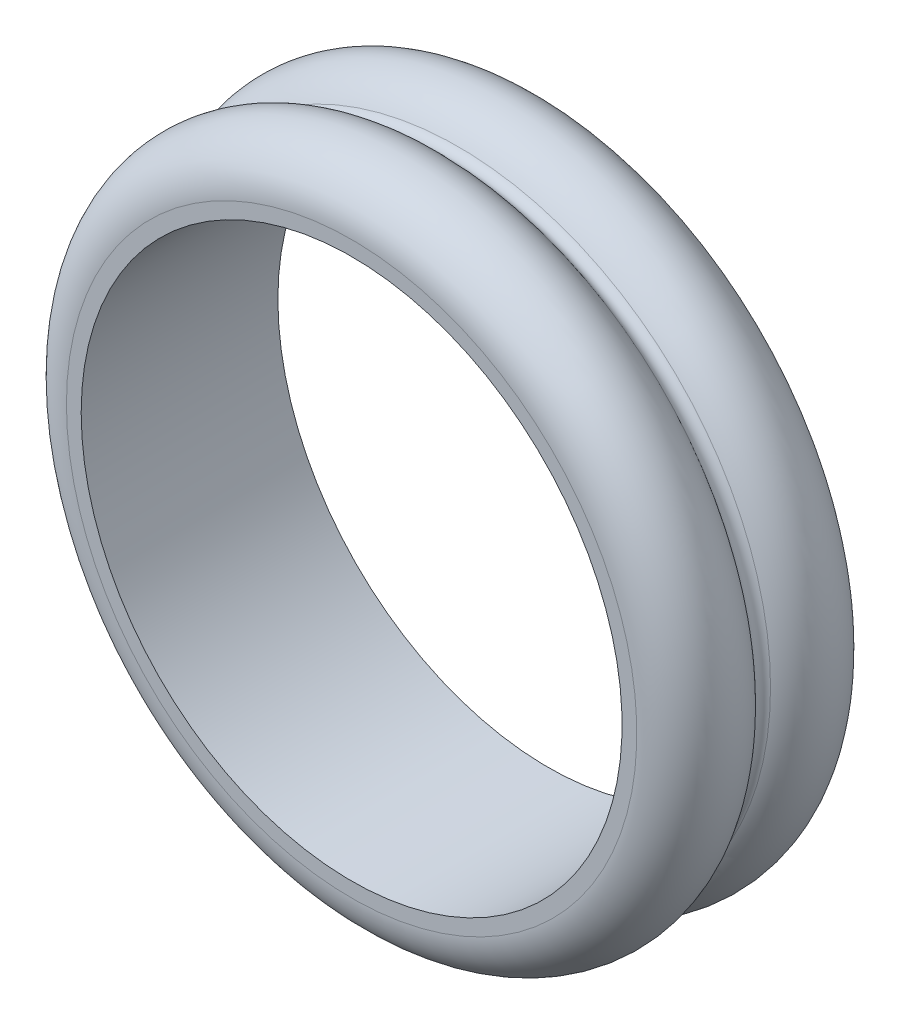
from build123d import *

# Parameters (mm, degrees)
SKETCH_2_R               = 5
EXTRUDE_1_DEPTH          = 10
PATTERN_CIRCULAR_1_COUNT = 6
EXTRUDE_2_DEPTH          = 7
SKETCH_4_R               = 1.4
CUT_EXTRUDE_1_DEPTH      = 50.325449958
PATTERN_CIRCULAR_2_COUNT = 6
SKETCH_5_R               = 5.5
EXTRUDE_3_DEPTH          = 5
SKETCH_7_R               = 7
CUT_EXTRUDE_3_DEPTH      = 1.5
CUT_EXTRUDE_3_DRAFT      = -40
SKETCH_8_R               = 1.5
CUT_EXTRUDE_4_DEPTH      = 51.222007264
SKETCH_10_R              = 1.25
CUT_EXTRUDE_6_DEPTH      = 51.675437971
PATTERN_CIRCULAR_3_COUNT = 6
SKETCH_11_R              = 2.5
CUT_EXTRUDE_7_DEPTH      = 51.675437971
PATTERN_CIRCULAR_4_COUNT = 2
CUT_EXTRUDE_8_DEPTH      = 8
PATTERN_CIRCULAR_5_COUNT = 6
CUT_EXTRUDE_9_DEPTH      = 8
SKETCH_14_R              = 27.5
CUT_EXTRUDE_11_DEPTH     = 55


with BuildPart() as part:
    # Sketch 1 → Revolve 1 (revolve)
    with BuildSketch(Plane(origin=(0, 0, 0), x_dir=(1, 0, 0), z_dir=(0, 1, 0)), mode=Mode.PRIVATE) as revolve_1_sk:
        with BuildLine():
            Line((25, 10), (25, -10))
            Line((25, -10), (29, -10))
            ThreePointArc((29, -10), (33.787135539, -6.443375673), (31.763853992, -0.833333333))
            ThreePointArc((31.763853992, -0.833333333), (31.31662479, 0), (31.763853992, 0.833333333))
            ThreePointArc((31.763853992, 0.833333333), (33.787135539, 6.443375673), (29, 10))
            Line((29, 10), (25, 10))
        make_face()
    revolve(revolve_1_sk.sketch.rotate(Axis((0, 0, -146.934042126), (0, 0, 1)), 180), axis=Axis((0, 0, -146.934042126), (0, 0, 1)))

    # Sketch 2 → Extrude 1 (add)
    with BuildSketch(Plane.XY.offset(6)):
        with Locations((0, 21.5)):
            Circle(SKETCH_2_R)
    extrude_1 = extrude(amount=-EXTRUDE_1_DEPTH)

    # Pattern Circular 1: Extrude 1 ×6 about axis
    pattern_circular_1_axis = Axis((0, 0, 0), (0, 0, 1))
    for i in range(1, PATTERN_CIRCULAR_1_COUNT):
        add(extrude_1.rotate(pattern_circular_1_axis, i * 360 / PATTERN_CIRCULAR_1_COUNT))

    # Sketch 3 → Extrude 2 (add)
    with BuildSketch(Plane.XY.offset(6)):
        with BuildLine():
            Line((-8.082903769, 0), (-10.874355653, -4.834936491))
            Line((-10.874355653, -4.834936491), (-15.051918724, -7.246853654))
            ThreePointArc((-15.051918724, -7.246853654), (-14.289419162, -8.25), (-13.801918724, -9.411917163))
            Line((-13.801918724, -9.411917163), (-9.624355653, -7))
            Line((-9.624355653, -7), (-4.041451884, -7))
            Line((-4.041451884, -7), (-1.25, -11.834936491))
            Line((-1.25, -11.834936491), (-1.25, -16.658770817))
            ThreePointArc((-1.25, -16.658770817), (0, -16.5), (1.25, -16.658770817))
            Line((1.25, -16.658770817), (1.25, -11.834936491))
            Line((1.25, -11.834936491), (4.041451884, -7))
            Line((4.041451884, -7), (9.624355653, -7))
            Line((9.624355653, -7), (13.801918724, -9.411917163))
            ThreePointArc((13.801918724, -9.411917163), (14.289419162, -8.25), (15.051918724, -7.246853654))
            Line((15.051918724, -7.246853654), (10.874355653, -4.834936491))
            Line((10.874355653, -4.834936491), (8.082903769, 0))
            Line((8.082903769, 0), (10.874355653, 4.834936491))
            Line((10.874355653, 4.834936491), (15.051918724, 7.246853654))
            ThreePointArc((15.051918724, 7.246853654), (14.289419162, 8.25), (13.801918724, 9.411917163))
            Line((13.801918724, 9.411917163), (9.624355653, 7))
            Line((9.624355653, 7), (4.041451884, 7))
            Line((4.041451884, 7), (1.25, 11.834936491))
            Line((1.25, 11.834936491), (1.25, 16.658770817))
            ThreePointArc((1.25, 16.658770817), (0, 16.5), (-1.25, 16.658770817))
            Line((-1.25, 16.658770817), (-1.25, 11.834936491))
            Line((-1.25, 11.834936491), (-4.041451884, 7))
            Line((-4.041451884, 7), (-9.624355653, 7))
            Line((-9.624355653, 7), (-13.801918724, 9.411917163))
            ThreePointArc((-13.801918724, 9.411917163), (-14.289419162, 8.25), (-15.051918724, 7.246853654))
            Line((-15.051918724, 7.246853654), (-10.874355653, 4.834936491))
            Line((-10.874355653, 4.834936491), (-8.082903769, 0))
        make_face()
    extrude(amount=-EXTRUDE_2_DEPTH)

    # Sketch 4 → Cut-Extrude 1 (cut, through all)
    with BuildSketch(Plane(origin=(0, 0, -1), x_dir=(-1, 0, 0), z_dir=(0, 0, -1))):
        with Locations((0, 8.5)):
            Circle(SKETCH_4_R)
    cut_extrude_1 = extrude(amount=-CUT_EXTRUDE_1_DEPTH, mode=Mode.SUBTRACT)

    # Pattern Circular 2: Cut-Extrude 1 ×6 about axis
    pattern_circular_2_axis = Axis((0, 0, 0), (0, 0, 1))
    for i in range(1, PATTERN_CIRCULAR_2_COUNT):
        add(cut_extrude_1.rotate(pattern_circular_2_axis, i * 360 / PATTERN_CIRCULAR_2_COUNT), mode=Mode.SUBTRACT)

    # Sketch 5 → Extrude 3 (add)
    with BuildSketch(Plane(origin=(0, 0, -1), x_dir=(-1, 0, 0), z_dir=(0, 0, -1))):
        with Locations(Location((0, 0, 0), (0, 0, 180))):
            Circle(SKETCH_5_R)
    extrude(amount=EXTRUDE_3_DEPTH)


with BuildPart() as cut_extrude_3_tool:
    # Sketch 7 → Cut-Extrude 3 (with draft: the straight prism first)
    with BuildSketch(Plane.XY.offset(6)):
        Circle(SKETCH_7_R)
    extrude(amount=-CUT_EXTRUDE_3_DEPTH)
    # Cut-Extrude 3: the draft: its side faces are tilted about the plane it starts from
    cut_extrude_3_sides = [cut_extrude_3_tool.faces().sort_by_distance(p)[0] for p in [
        (-7, 0, 5.25),
    ]]
    draft(cut_extrude_3_sides, Plane.XY.offset(6), CUT_EXTRUDE_3_DRAFT)


with BuildPart() as part_1:
    add(part.part)

    # Cut-Extrude 3: cut by cut_extrude_3_tool
    add(cut_extrude_3_tool.part, mode=Mode.SUBTRACT)

    # Sketch 8 → Cut-Extrude 4 (cut, through all)
    with BuildSketch(Plane.XY.offset(4.5)):
        Circle(SKETCH_8_R)
    extrude(amount=-CUT_EXTRUDE_4_DEPTH, mode=Mode.SUBTRACT)

    # Sketch 10 → Cut-Extrude 6 (cut, through all)
    with BuildSketch(Plane.XY.offset(6)):
        with Locations((0, 21.5)):
            Circle(SKETCH_10_R)
    cut_extrude_6 = extrude(amount=-CUT_EXTRUDE_6_DEPTH, mode=Mode.SUBTRACT)

    # Pattern Circular 3: Cut-Extrude 6 ×6 about axis
    pattern_circular_3_axis = Axis((0, 0, 0), (0, 0, 1))
    for i in range(1, PATTERN_CIRCULAR_3_COUNT):
        add(cut_extrude_6.rotate(pattern_circular_3_axis, i * 360 / PATTERN_CIRCULAR_3_COUNT), mode=Mode.SUBTRACT)

    # Sketch 11 → Cut-Extrude 7 (cut, through all)
    with BuildSketch(Plane.XY.offset(6)):
        with Locations((0, 21.5)):
            Circle(SKETCH_11_R)
    cut_extrude_7 = extrude(amount=-CUT_EXTRUDE_7_DEPTH, mode=Mode.SUBTRACT)

    # Pattern Circular 4: Cut-Extrude 7 ×2 about axis
    pattern_circular_4_axis = Axis((0, 0, 0), (0, 0, 1))
    for i in range(1, PATTERN_CIRCULAR_4_COUNT):
        add(cut_extrude_7.rotate(pattern_circular_4_axis, i * 360 / PATTERN_CIRCULAR_4_COUNT), mode=Mode.SUBTRACT)

    # Sketch 12 → Cut-Extrude 8 (cut)
    with BuildSketch(Plane.XY.offset(6)):
        Polygon((20.062921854, 8.25), (21.506297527, 10.75), (20.062921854, 13.25), (17.176170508, 13.25), (15.732794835, 10.75), (17.176170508, 8.25), align=None)
    cut_extrude_8 = extrude(amount=-CUT_EXTRUDE_8_DEPTH, mode=Mode.SUBTRACT)

    # Pattern Circular 5: Cut-Extrude 8 ×6 about axis, 2 skipped
    pattern_circular_5_axis = Axis((0, 0, 0), (0, 0, -1))
    add([cut_extrude_8.rotate(pattern_circular_5_axis, i * 360 / PATTERN_CIRCULAR_5_COUNT) for i in range(1, PATTERN_CIRCULAR_5_COUNT) if i not in (2, 5)], mode=Mode.SUBTRACT)

    # Sketch 9 → Cut-Extrude 9 (cut)
    with BuildSketch(Plane(origin=(0, 0, -6), x_dir=(-1, 0, 0), z_dir=(0, 0, -1))):
        Polygon((3.5, 0), (1.75, 3.031088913), (-1.75, 3.031088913), (-3.5, 0), (-1.75, -3.031088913), (1.75, -3.031088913), align=None)
    extrude(amount=-CUT_EXTRUDE_9_DEPTH, mode=Mode.SUBTRACT)

    # Sketch 14 → Cut-Extrude 11 (cut)
    with BuildSketch(Plane(origin=(0, 0, -10), x_dir=(-1, 0, 0), z_dir=(0, 0, -1))):
        Circle(SKETCH_14_R)
    extrude(amount=-CUT_EXTRUDE_11_DEPTH, mode=Mode.SUBTRACT)


solid = part_1.part
